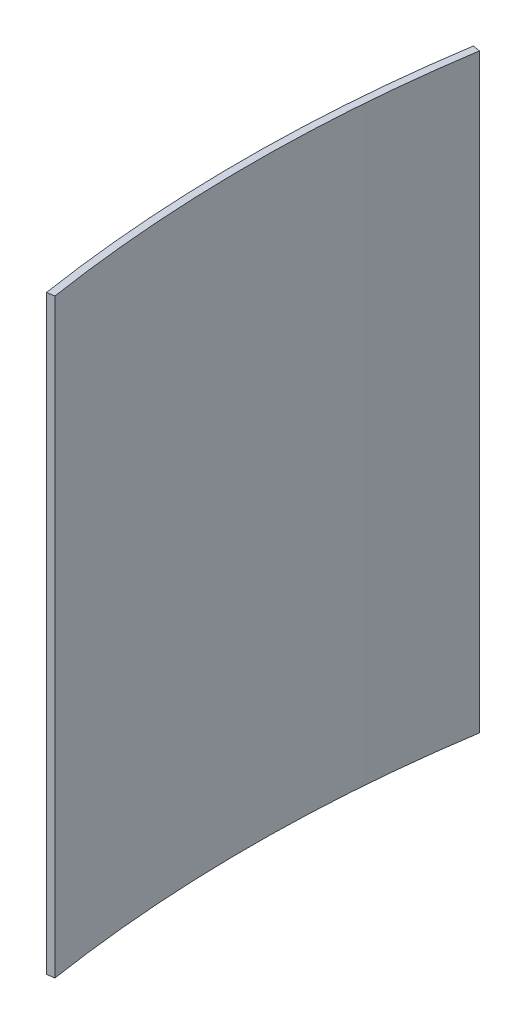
ISO-10303-21;
HEADER;
FILE_DESCRIPTION(('STEP AP214'),'2;1');
FILE_NAME('part.step','',(''),(''),'','','');
FILE_SCHEMA(('AUTOMOTIVE_DESIGN { 1 0 10303 214 1 1 1 1 }'));
ENDSEC;
DATA;
#1=APPLICATION_CONTEXT('core data for automotive mechanical design processes');
#2=APPLICATION_PROTOCOL_DEFINITION('international standard','automotive_design',2000,#1);
#3=PRODUCT_CONTEXT('',#1,'mechanical');
#4=PRODUCT('Part','Part','',(#3));
#5=PRODUCT_RELATED_PRODUCT_CATEGORY('part','',(#4));
#6=PRODUCT_DEFINITION_FORMATION('','',#4);
#7=PRODUCT_DEFINITION_CONTEXT('part definition',#1,'design');
#8=PRODUCT_DEFINITION('design','',#6,#7);
#9=PRODUCT_DEFINITION_SHAPE('','',#8);
#10=(LENGTH_UNIT() NAMED_UNIT(*) SI_UNIT(.MILLI.,.METRE.));
#11=(NAMED_UNIT(*) PLANE_ANGLE_UNIT() SI_UNIT($,.RADIAN.));
#12=(NAMED_UNIT(*) SI_UNIT($,.STERADIAN.) SOLID_ANGLE_UNIT());
#13=UNCERTAINTY_MEASURE_WITH_UNIT(LENGTH_MEASURE(1.E-05),#10,'distance_accuracy_value','');
#14=(GEOMETRIC_REPRESENTATION_CONTEXT(3) GLOBAL_UNCERTAINTY_ASSIGNED_CONTEXT((#13)) GLOBAL_UNIT_ASSIGNED_CONTEXT((#10,
#11,#12)) REPRESENTATION_CONTEXT('',''));
#15=CARTESIAN_POINT('',(0.,0.,0.));
#16=DIRECTION('',(0.,0.,1.));
#17=DIRECTION('',(1.,0.,0.));
#18=AXIS2_PLACEMENT_3D('',#15,#16,#17);
#19=CARTESIAN_POINT('',(0.,320.,0.));
#20=DIRECTION('',(0.,-1.,0.));
#21=DIRECTION('',(0.,0.,-1.));
#22=AXIS2_PLACEMENT_3D('',#19,#20,#21);
#23=CYLINDRICAL_SURFACE('',#22,750.);
#24=CARTESIAN_POINT('',(0.,0.,0.));
#25=DIRECTION('',(0.,-1.,0.));
#26=DIRECTION('',(0.,0.,1.));
#27=AXIS2_PLACEMENT_3D('',#24,#25,#26);
#28=CIRCLE('',#27,750.);
#29=CARTESIAN_POINT('',(-741.130892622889,0.,115.));
#30=VERTEX_POINT('',#29);
#31=CARTESIAN_POINT('',(-741.130892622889,0.,-115.));
#32=VERTEX_POINT('',#31);
#33=EDGE_CURVE('E92',#30,#32,#28,.T.);
#34=ORIENTED_EDGE('',*,*,#33,.T.);
#35=DIRECTION('',(0.,-1.,0.));
#36=VECTOR('',#35,1.);
#37=CARTESIAN_POINT('',(-741.130892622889,320.,-115.));
#38=LINE('',#37,#36);
#39=CARTESIAN_POINT('',(-741.130892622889,320.,-115.));
#40=VERTEX_POINT('',#39);
#41=EDGE_CURVE('E11',#40,#32,#38,.T.);
#42=ORIENTED_EDGE('',*,*,#41,.F.);
#43=CARTESIAN_POINT('',(0.,320.,0.));
#44=DIRECTION('',(0.,-1.,0.));
#45=DIRECTION('',(0.,0.,1.));
#46=AXIS2_PLACEMENT_3D('',#43,#44,#45);
#47=CIRCLE('',#46,750.);
#48=CARTESIAN_POINT('',(-741.130892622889,320.,115.));
#49=VERTEX_POINT('',#48);
#50=EDGE_CURVE('E80',#49,#40,#47,.T.);
#51=ORIENTED_EDGE('',*,*,#50,.F.);
#52=DIRECTION('',(0.,-1.,0.));
#53=VECTOR('',#52,1.);
#54=CARTESIAN_POINT('',(-741.130892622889,320.,115.));
#55=LINE('',#54,#53);
#56=EDGE_CURVE('E88',#49,#30,#55,.T.);
#57=ORIENTED_EDGE('',*,*,#56,.T.);
#58=EDGE_LOOP('',(#34,#42,#51,#57));
#59=FACE_BOUND('',#58,.T.);
#60=ADVANCED_FACE('F29',(#59),#23,.F.);
#61=CARTESIAN_POINT('',(-741.130892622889,320.,-115.));
#62=DIRECTION('',(-0.153333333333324,0.,0.988174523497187));
#63=DIRECTION('',(0.988174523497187,0.,0.153333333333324));
#64=AXIS2_PLACEMENT_3D('',#61,#62,#63);
#65=PLANE('',#64);
#66=DIRECTION('',(-0.988174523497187,0.,-0.153333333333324));
#67=VECTOR('',#66,1.);
#68=CARTESIAN_POINT('',(-741.130892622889,0.,-115.));
#69=LINE('',#68,#67);
#70=CARTESIAN_POINT('',(-745.083590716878,0.,-115.613333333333));
#71=VERTEX_POINT('',#70);
#72=EDGE_CURVE('E84',#32,#71,#69,.T.);
#73=ORIENTED_EDGE('',*,*,#72,.T.);
#74=DIRECTION('',(0.,-1.,0.));
#75=VECTOR('',#74,1.);
#76=CARTESIAN_POINT('',(-745.083590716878,320.,-115.613333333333));
#77=LINE('',#76,#75);
#78=CARTESIAN_POINT('',(-745.083590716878,320.,-115.613333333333));
#79=VERTEX_POINT('',#78);
#80=EDGE_CURVE('E37',#79,#71,#77,.T.);
#81=ORIENTED_EDGE('',*,*,#80,.F.);
#82=DIRECTION('',(-0.988174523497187,0.,-0.153333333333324));
#83=VECTOR('',#82,1.);
#84=CARTESIAN_POINT('',(-741.130892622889,320.,-115.));
#85=LINE('',#84,#83);
#86=EDGE_CURVE('E75',#40,#79,#85,.T.);
#87=ORIENTED_EDGE('',*,*,#86,.F.);
#88=ORIENTED_EDGE('',*,*,#41,.T.);
#89=EDGE_LOOP('',(#73,#81,#87,#88));
#90=FACE_BOUND('',#89,.T.);
#91=ADVANCED_FACE('F83',(#90),#65,.F.);
#92=CARTESIAN_POINT('',(0.,320.,0.));
#93=DIRECTION('',(0.,-1.,0.));
#94=DIRECTION('',(0.,0.,-1.));
#95=AXIS2_PLACEMENT_3D('',#92,#93,#94);
#96=CYLINDRICAL_SURFACE('',#95,754.);
#97=CARTESIAN_POINT('',(0.,0.,0.));
#98=DIRECTION('',(0.,1.,0.));
#99=DIRECTION('',(0.,0.,1.));
#100=AXIS2_PLACEMENT_3D('',#97,#98,#99);
#101=CIRCLE('',#100,754.);
#102=CARTESIAN_POINT('',(-745.083590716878,0.,115.613333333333));
#103=VERTEX_POINT('',#102);
#104=EDGE_CURVE('E62',#71,#103,#101,.T.);
#105=ORIENTED_EDGE('',*,*,#104,.T.);
#106=DIRECTION('',(0.,-1.,0.));
#107=VECTOR('',#106,1.);
#108=CARTESIAN_POINT('',(-745.083590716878,320.,115.613333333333));
#109=LINE('',#108,#107);
#110=CARTESIAN_POINT('',(-745.083590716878,320.,115.613333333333));
#111=VERTEX_POINT('',#110);
#112=EDGE_CURVE('E85',#111,#103,#109,.T.);
#113=ORIENTED_EDGE('',*,*,#112,.F.);
#114=CARTESIAN_POINT('',(0.,320.,0.));
#115=DIRECTION('',(0.,1.,0.));
#116=DIRECTION('',(0.,0.,1.));
#117=AXIS2_PLACEMENT_3D('',#114,#115,#116);
#118=CIRCLE('',#117,754.);
#119=EDGE_CURVE('E78',#79,#111,#118,.T.);
#120=ORIENTED_EDGE('',*,*,#119,.F.);
#121=ORIENTED_EDGE('',*,*,#80,.T.);
#122=EDGE_LOOP('',(#105,#113,#120,#121));
#123=FACE_BOUND('',#122,.T.);
#124=ADVANCED_FACE('F86',(#123),#96,.T.);
#125=CARTESIAN_POINT('',(-741.130892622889,320.,115.));
#126=DIRECTION('',(-0.15333333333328,0.,-0.988174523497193));
#127=DIRECTION('',(-0.988174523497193,0.,0.15333333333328));
#128=AXIS2_PLACEMENT_3D('',#125,#126,#127);
#129=PLANE('',#128);
#130=DIRECTION('',(0.988174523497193,0.,-0.15333333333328));
#131=VECTOR('',#130,1.);
#132=CARTESIAN_POINT('',(-741.130892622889,0.,115.));
#133=LINE('',#132,#131);
#134=EDGE_CURVE('E68',#103,#30,#133,.T.);
#135=ORIENTED_EDGE('',*,*,#134,.T.);
#136=ORIENTED_EDGE('',*,*,#56,.F.);
#137=DIRECTION('',(0.988174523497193,0.,-0.15333333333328));
#138=VECTOR('',#137,1.);
#139=CARTESIAN_POINT('',(-741.130892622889,320.,115.));
#140=LINE('',#139,#138);
#141=EDGE_CURVE('E45',#111,#49,#140,.T.);
#142=ORIENTED_EDGE('',*,*,#141,.F.);
#143=ORIENTED_EDGE('',*,*,#112,.T.);
#144=EDGE_LOOP('',(#135,#136,#142,#143));
#145=FACE_BOUND('',#144,.T.);
#146=ADVANCED_FACE('F99',(#145),#129,.F.);
#147=CARTESIAN_POINT('',(0.,320.,0.));
#148=DIRECTION('',(0.,1.,0.));
#149=DIRECTION('',(0.,0.,1.));
#150=AXIS2_PLACEMENT_3D('',#147,#148,#149);
#151=PLANE('',#150);
#152=ORIENTED_EDGE('',*,*,#50,.T.);
#153=ORIENTED_EDGE('',*,*,#86,.T.);
#154=ORIENTED_EDGE('',*,*,#119,.T.);
#155=ORIENTED_EDGE('',*,*,#141,.T.);
#156=EDGE_LOOP('',(#152,#153,#154,#155));
#157=FACE_BOUND('',#156,.T.);
#158=ADVANCED_FACE('F76',(#157),#151,.T.);
#159=CARTESIAN_POINT('',(0.,0.,0.));
#160=DIRECTION('',(0.,1.,0.));
#161=DIRECTION('',(0.,0.,1.));
#162=AXIS2_PLACEMENT_3D('',#159,#160,#161);
#163=PLANE('',#162);
#164=ORIENTED_EDGE('',*,*,#33,.F.);
#165=ORIENTED_EDGE('',*,*,#134,.F.);
#166=ORIENTED_EDGE('',*,*,#104,.F.);
#167=ORIENTED_EDGE('',*,*,#72,.F.);
#168=EDGE_LOOP('',(#164,#165,#166,#167));
#169=FACE_BOUND('',#168,.T.);
#170=ADVANCED_FACE('F102',(#169),#163,.F.);
#171=CLOSED_SHELL('',(#60,#91,#124,#146,#158,#170));
#172=MANIFOLD_SOLID_BREP('B2',#171);
#173=ADVANCED_BREP_SHAPE_REPRESENTATION('',(#18,#172),#14);
#174=SHAPE_DEFINITION_REPRESENTATION(#9,#173);
ENDSEC;
END-ISO-10303-21;
